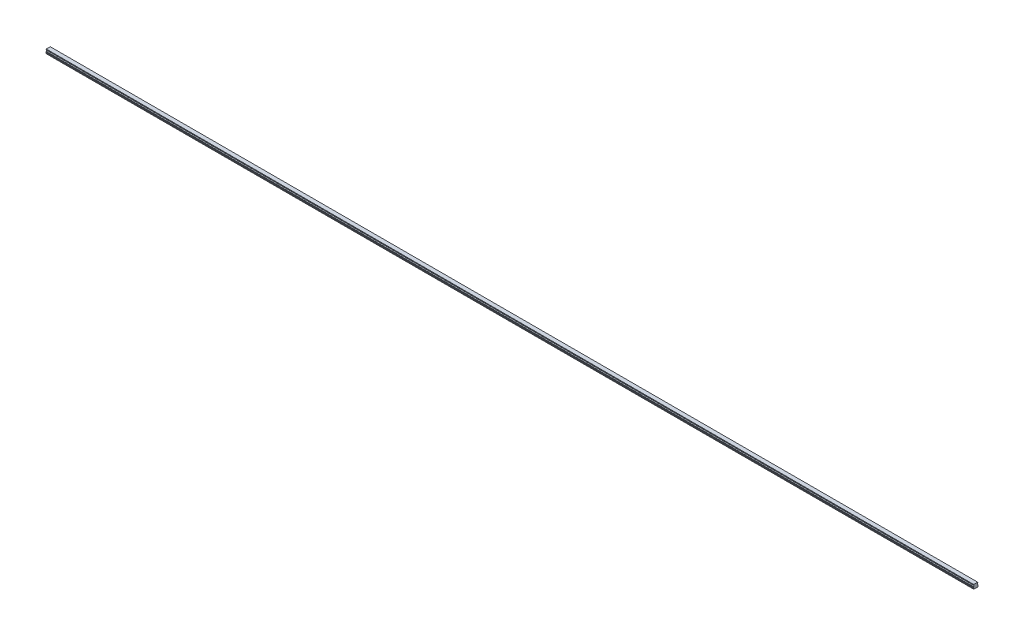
from build123d import *

# Parameters (mm, degrees)
BOSS_EXTRUDE1_DEPTH        = 3060
SKETCH3_R                  = 2.5
SKETCH3_R_2                = 2.1
CUT_EXTRUDE3_DEPTH         = 7
SKETCH3_2_R                = 2.1
CUT_EXTRUDE4_DEPTH         = 9.5
CHAMFER1_SIZE              = 0.4
LPATTERN2_COUNT            = 51
LPATTERN2_PITCH            = 60
CHAMFER1_OF_LPATTERN2_SIZE = 0.4


with BuildPart() as part:
    # Sketch1 → Boss-Extrude1 (new body)
    with BuildSketch(Plane(origin=(0, 0, 0), x_dir=(0, 0, -1), z_dir=(1, 0, 0))):
        with BuildLine():
            Line((6.59, 14), (-6.59, 14))
            Line((-6.59, 14), (-6.59, 13.15))
            Line((-6.59, 13.15), (-6.96, 12.356532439))
            Line((-6.96, 12.356532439), (-6.96, 11.435174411))
            ThreePointArc((-6.96, 11.435174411), (-5.25, 9.5), (-6.96, 7.564825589))
            Line((-6.96, 7.564825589), (-6.96, 6.643467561))
            Line((-6.96, 6.643467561), (-6.59, 5.85))
            Line((-6.59, 5.85), (-7.032116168, 4.2))
            Line((-7.032116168, 4.2), (-7.5, 3.929867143))
            Line((-7.5, 3.929867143), (-7.5, 1.4))
            Line((-7.5, 1.4), (-6.1, 0))
            Line((-6.1, 0), (-3.65, 0))
            Line((-3.65, 0), (-3.25, 0.4))
            Line((-3.25, 0.4), (3.25, 0.4))
            Line((3.25, 0.4), (3.65, 0))
            Line((3.65, 0), (6.1, 0))
            Line((6.1, 0), (7.5, 1.4))
            Line((7.5, 1.4), (7.5, 3.929867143))
            Line((7.5, 3.929867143), (7.032116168, 4.2))
            Line((7.032116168, 4.2), (6.59, 5.85))
            Line((6.59, 5.85), (6.96, 6.643467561))
            Line((6.96, 6.643467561), (6.96, 7.564825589))
            ThreePointArc((6.96, 7.564825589), (5.25, 9.5), (6.96, 11.435174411))
            Line((6.96, 11.435174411), (6.96, 12.356532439))
            Line((6.96, 12.356532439), (6.59, 13.15))
            Line((6.59, 13.15), (6.59, 14))
        make_face()
    extrude(amount=BOSS_EXTRUDE1_DEPTH)

    # Sketch3 → Cut-Extrude3 (cut)
    with BuildSketch(Plane.XZ):
        with Locations(Location((30, 0, 0), (0, 0, 270))):
            Circle(SKETCH3_R)
        with Locations(Location((30, 0, 0), (0, 0, 270))):
            Circle(SKETCH3_R_2, mode=Mode.SUBTRACT)
    cut_extrude3 = extrude(amount=-CUT_EXTRUDE3_DEPTH, mode=Mode.SUBTRACT)

    # Sketch3_2 → Cut-Extrude4 (cut)
    with BuildSketch(Plane.XZ):
        with Locations(Location((30, 0, 0), (0, 0, 270))):
            Circle(SKETCH3_2_R)
    cut_extrude4 = extrude(amount=-CUT_EXTRUDE4_DEPTH, mode=Mode.SUBTRACT)

    # Cut-Extrude5 cone 1 section (on through the dimple's axis) → Cut-Extrude5 (revolve, cut)
    with BuildSketch(Plane(origin=(30, 9.5, 0), x_dir=(0, 0, -1), z_dir=(1, 0, 0))):
        Polygon((0, 0), (2.1, 0), (0, 1.212435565), align=None)
    revolve(axis=Axis((30, 9.5, 0), (0, 1, 0)), mode=Mode.SUBTRACT)

    # Chamfer1
    chamfer1_edges = [part.edges().sort_by_distance(p)[0] for p in [
        (30, 0.4, 2.5),
    ]]
    chamfer(chamfer1_edges, length=CHAMFER1_SIZE)

    # LPattern2: Cut-Extrude3, Cut-Extrude4 ×51
    with Locations(*[(i * LPATTERN2_PITCH, 0, 0) for i in range(1, LPATTERN2_COUNT)]):
        add(cut_extrude3, mode=Mode.SUBTRACT)
        add(cut_extrude4, mode=Mode.SUBTRACT)

    # Chamfer1 of LPattern2
    chamfer1_of_lpattern2_edges = [part.edges().sort_by_distance(p)[0] for p in [
        (90, 0.4, 2.5),
        (150, 0.4, 2.5),
        (210, 0.4, 2.5),
        (270, 0.4, 2.5),
        (330, 0.4, 2.5),
        (390, 0.4, 2.5),
        (450, 0.4, 2.5),
        (510, 0.4, 2.5),
        (570, 0.4, 2.5),
        (630, 0.4, 2.5),
        (690, 0.4, 2.5),
        (750, 0.4, 2.5),
        (810, 0.4, 2.5),
        (870, 0.4, 2.5),
        (930, 0.4, 2.5),
        (990, 0.4, 2.5),
        (1050, 0.4, 2.5),
        (1110, 0.4, 2.5),
        (1170, 0.4, 2.5),
        (1230, 0.4, 2.5),
        (1290, 0.4, 2.5),
        (1350, 0.4, 2.5),
        (1410, 0.4, 2.5),
        (1470, 0.4, 2.5),
        (1530, 0.4, 2.5),
        (1590, 0.4, 2.5),
        (1650, 0.4, 2.5),
        (1710, 0.4, 2.5),
        (1770, 0.4, 2.5),
        (1830, 0.4, 2.5),
        (1890, 0.4, 2.5),
        (1950, 0.4, 2.5),
        (2010, 0.4, 2.5),
        (2070, 0.4, 2.5),
        (2130, 0.4, 2.5),
        (2190, 0.4, 2.5),
        (2250, 0.4, 2.5),
        (2310, 0.4, 2.5),
        (2370, 0.4, 2.5),
        (2430, 0.4, 2.5),
        (2490, 0.4, 2.5),
        (2550, 0.4, 2.5),
        (2610, 0.4, 2.5),
        (2670, 0.4, 2.5),
        (2730, 0.4, 2.5),
        (2790, 0.4, 2.5),
        (2850, 0.4, 2.5),
        (2910, 0.4, 2.5),
        (2970, 0.4, 2.5),
        (3030, 0.4, 2.5),
    ]]
    chamfer(chamfer1_of_lpattern2_edges, length=CHAMFER1_OF_LPATTERN2_SIZE)


solid = part.part
